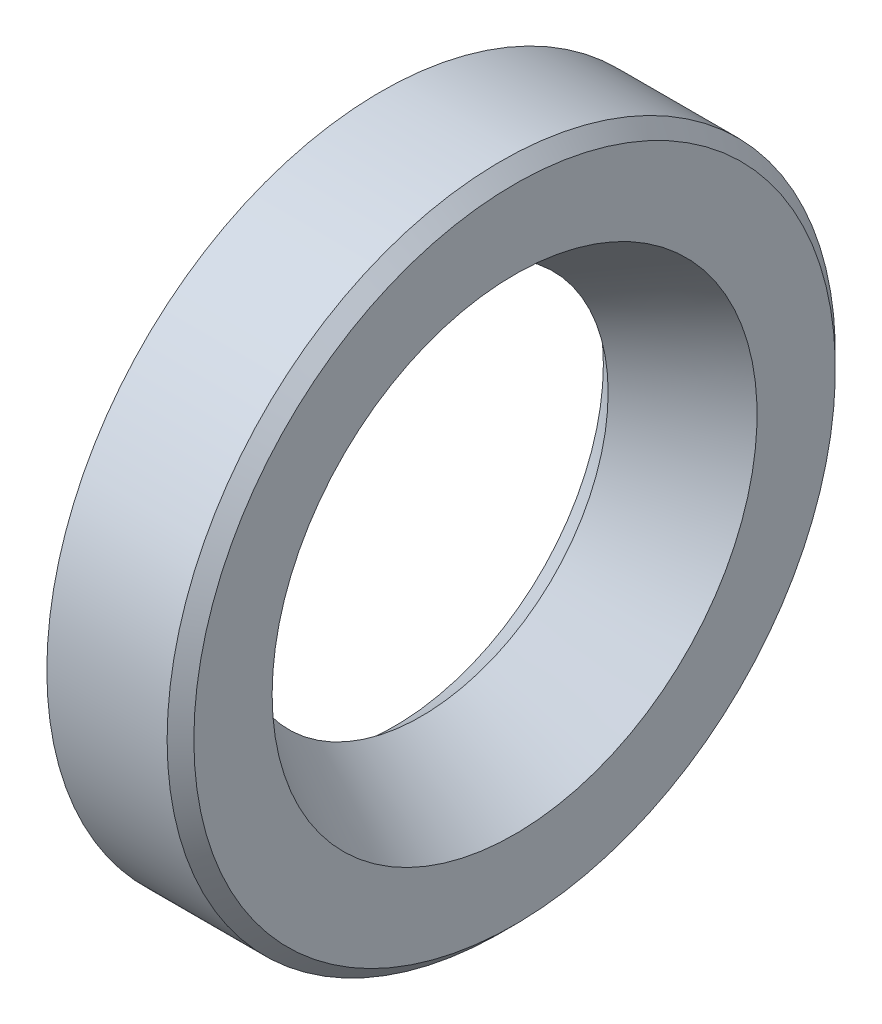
ISO-10303-21;
HEADER;
FILE_DESCRIPTION(('STEP AP214'),'2;1');
FILE_NAME('part.step','',(''),(''),'','','');
FILE_SCHEMA(('AUTOMOTIVE_DESIGN { 1 0 10303 214 1 1 1 1 }'));
ENDSEC;
DATA;
#1=APPLICATION_CONTEXT('core data for automotive mechanical design processes');
#2=APPLICATION_PROTOCOL_DEFINITION('international standard','automotive_design',2000,#1);
#3=PRODUCT_CONTEXT('',#1,'mechanical');
#4=PRODUCT('Part','Part','',(#3));
#5=PRODUCT_RELATED_PRODUCT_CATEGORY('part','',(#4));
#6=PRODUCT_DEFINITION_FORMATION('','',#4);
#7=PRODUCT_DEFINITION_CONTEXT('part definition',#1,'design');
#8=PRODUCT_DEFINITION('design','',#6,#7);
#9=PRODUCT_DEFINITION_SHAPE('','',#8);
#10=(LENGTH_UNIT() NAMED_UNIT(*) SI_UNIT(.MILLI.,.METRE.));
#11=(NAMED_UNIT(*) PLANE_ANGLE_UNIT() SI_UNIT($,.RADIAN.));
#12=(NAMED_UNIT(*) SI_UNIT($,.STERADIAN.) SOLID_ANGLE_UNIT());
#13=UNCERTAINTY_MEASURE_WITH_UNIT(LENGTH_MEASURE(1.E-05),#10,'distance_accuracy_value','');
#14=(GEOMETRIC_REPRESENTATION_CONTEXT(3) GLOBAL_UNCERTAINTY_ASSIGNED_CONTEXT((#13)) GLOBAL_UNIT_ASSIGNED_CONTEXT((#10,
#11,#12)) REPRESENTATION_CONTEXT('',''));
#15=CARTESIAN_POINT('',(0.,0.,0.));
#16=DIRECTION('',(0.,0.,1.));
#17=DIRECTION('',(1.,0.,0.));
#18=AXIS2_PLACEMENT_3D('',#15,#16,#17);
#19=CARTESIAN_POINT('',(5.66666666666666,0.,0.));
#20=DIRECTION('',(-1.,0.,0.));
#21=DIRECTION('',(0.,0.,1.));
#22=AXIS2_PLACEMENT_3D('',#19,#20,#21);
#23=TOROIDAL_SURFACE('',#22,22.2222222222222,0.999999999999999);
#24=CARTESIAN_POINT('',(6.66666666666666,0.,0.));
#25=DIRECTION('',(-1.,0.,0.));
#26=DIRECTION('',(0.,0.,1.));
#27=AXIS2_PLACEMENT_3D('',#24,#25,#26);
#28=CIRCLE('',#27,22.2222222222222);
#29=CARTESIAN_POINT('',(6.66666666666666,0.,22.2222222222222));
#30=VERTEX_POINT('',#29);
#31=EDGE_CURVE('E10',#30,#30,#28,.T.);
#32=ORIENTED_EDGE('',*,*,#31,.F.);
#33=EDGE_LOOP('',(#32));
#34=FACE_BOUND('',#33,.T.);
#35=CARTESIAN_POINT('',(5.66666666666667,0.,0.));
#36=DIRECTION('',(-1.,0.,0.));
#37=DIRECTION('',(0.,0.,1.));
#38=AXIS2_PLACEMENT_3D('',#35,#36,#37);
#39=CIRCLE('',#38,23.2222222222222);
#40=CARTESIAN_POINT('',(5.66666666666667,0.,23.2222222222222));
#41=VERTEX_POINT('',#40);
#42=EDGE_CURVE('E76',#41,#41,#39,.T.);
#43=ORIENTED_EDGE('',*,*,#42,.T.);
#44=EDGE_LOOP('',(#43));
#45=FACE_BOUND('',#44,.T.);
#46=ADVANCED_FACE('F30',(#34,#45),#23,.F.);
#47=CARTESIAN_POINT('',(6.66666666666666,22.2222222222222,0.));
#48=DIRECTION('',(1.,0.,0.));
#49=DIRECTION('',(0.,0.,-1.));
#50=AXIS2_PLACEMENT_3D('',#47,#48,#49);
#51=PLANE('',#50);
#52=CARTESIAN_POINT('',(6.66666666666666,0.,0.));
#53=DIRECTION('',(-1.,0.,0.));
#54=DIRECTION('',(0.,0.,1.));
#55=AXIS2_PLACEMENT_3D('',#52,#53,#54);
#56=CIRCLE('',#55,18.1428571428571);
#57=CARTESIAN_POINT('',(6.66666666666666,0.,18.1428571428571));
#58=VERTEX_POINT('',#57);
#59=EDGE_CURVE('E36',#58,#58,#56,.T.);
#60=ORIENTED_EDGE('',*,*,#59,.F.);
#61=EDGE_LOOP('',(#60));
#62=FACE_BOUND('',#61,.T.);
#63=ORIENTED_EDGE('',*,*,#31,.T.);
#64=EDGE_LOOP('',(#63));
#65=FACE_BOUND('',#64,.T.);
#66=ADVANCED_FACE('F149',(#62,#65),#51,.F.);
#67=CARTESIAN_POINT('',(5.66666666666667,0.,0.));
#68=DIRECTION('',(-1.,0.,0.));
#69=DIRECTION('',(0.,0.,1.));
#70=AXIS2_PLACEMENT_3D('',#67,#68,#69);
#71=TOROIDAL_SURFACE('',#70,18.1428571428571,0.999999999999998);
#72=CARTESIAN_POINT('',(5.66666666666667,0.,0.));
#73=DIRECTION('',(-1.,0.,0.));
#74=DIRECTION('',(0.,0.,1.));
#75=AXIS2_PLACEMENT_3D('',#72,#73,#74);
#76=CIRCLE('',#75,17.1428571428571);
#77=CARTESIAN_POINT('',(5.66666666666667,0.,17.1428571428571));
#78=VERTEX_POINT('',#77);
#79=EDGE_CURVE('E40',#78,#78,#76,.T.);
#80=ORIENTED_EDGE('',*,*,#79,.F.);
#81=EDGE_LOOP('',(#80));
#82=FACE_BOUND('',#81,.T.);
#83=ORIENTED_EDGE('',*,*,#59,.T.);
#84=EDGE_LOOP('',(#83));
#85=FACE_BOUND('',#84,.T.);
#86=ADVANCED_FACE('F144',(#82,#85),#71,.F.);
#87=CARTESIAN_POINT('',(-10.,0.,0.));
#88=DIRECTION('',(-1.,0.,0.));
#89=DIRECTION('',(0.,0.,1.));
#90=AXIS2_PLACEMENT_3D('',#87,#88,#89);
#91=CYLINDRICAL_SURFACE('',#90,17.1428571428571);
#92=CARTESIAN_POINT('',(3.,0.,0.));
#93=DIRECTION('',(-1.,0.,0.));
#94=DIRECTION('',(0.,0.,1.));
#95=AXIS2_PLACEMENT_3D('',#92,#93,#94);
#96=CIRCLE('',#95,17.1428571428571);
#97=CARTESIAN_POINT('',(3.,0.,17.1428571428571));
#98=VERTEX_POINT('',#97);
#99=EDGE_CURVE('E44',#98,#98,#96,.T.);
#100=ORIENTED_EDGE('',*,*,#99,.F.);
#101=EDGE_LOOP('',(#100));
#102=FACE_BOUND('',#101,.T.);
#103=ORIENTED_EDGE('',*,*,#79,.T.);
#104=EDGE_LOOP('',(#103));
#105=FACE_BOUND('',#104,.T.);
#106=ADVANCED_FACE('F138',(#102,#105),#91,.T.);
#107=CARTESIAN_POINT('',(3.,0.,0.));
#108=DIRECTION('',(-1.,0.,0.));
#109=DIRECTION('',(0.,0.,1.));
#110=AXIS2_PLACEMENT_3D('',#107,#108,#109);
#111=TOROIDAL_SURFACE('',#110,18.1428571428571,0.999999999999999);
#112=CARTESIAN_POINT('',(2.,0.,0.));
#113=DIRECTION('',(-1.,0.,0.));
#114=DIRECTION('',(0.,0.,1.));
#115=AXIS2_PLACEMENT_3D('',#112,#113,#114);
#116=CIRCLE('',#115,18.1428571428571);
#117=CARTESIAN_POINT('',(2.,0.,18.1428571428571));
#118=VERTEX_POINT('',#117);
#119=EDGE_CURVE('E49',#118,#118,#116,.T.);
#120=ORIENTED_EDGE('',*,*,#119,.F.);
#121=EDGE_LOOP('',(#120));
#122=FACE_BOUND('',#121,.T.);
#123=ORIENTED_EDGE('',*,*,#99,.T.);
#124=EDGE_LOOP('',(#123));
#125=FACE_BOUND('',#124,.T.);
#126=ADVANCED_FACE('F132',(#122,#125),#111,.T.);
#127=CARTESIAN_POINT('',(-10.,0.,0.));
#128=DIRECTION('',(-1.,0.,0.));
#129=DIRECTION('',(0.,0.,1.));
#130=AXIS2_PLACEMENT_3D('',#127,#128,#129);
#131=CYLINDRICAL_SURFACE('',#130,18.1428571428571);
#132=CARTESIAN_POINT('',(0.999999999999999,0.,0.));
#133=DIRECTION('',(-1.,0.,0.));
#134=DIRECTION('',(0.,0.,1.));
#135=AXIS2_PLACEMENT_3D('',#132,#133,#134);
#136=CIRCLE('',#135,18.1428571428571);
#137=CARTESIAN_POINT('',(0.999999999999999,0.,18.1428571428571));
#138=VERTEX_POINT('',#137);
#139=EDGE_CURVE('E52',#138,#138,#136,.T.);
#140=ORIENTED_EDGE('',*,*,#139,.F.);
#141=EDGE_LOOP('',(#140));
#142=FACE_BOUND('',#141,.T.);
#143=ORIENTED_EDGE('',*,*,#119,.T.);
#144=EDGE_LOOP('',(#143));
#145=FACE_BOUND('',#144,.T.);
#146=ADVANCED_FACE('F126',(#142,#145),#131,.T.);
#147=CARTESIAN_POINT('',(1.,18.1428571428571,0.));
#148=DIRECTION('',(1.,0.,0.));
#149=DIRECTION('',(0.,0.,-1.));
#150=AXIS2_PLACEMENT_3D('',#147,#148,#149);
#151=PLANE('',#150);
#152=CARTESIAN_POINT('',(0.999999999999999,0.,0.));
#153=DIRECTION('',(-1.,0.,0.));
#154=DIRECTION('',(0.,0.,1.));
#155=AXIS2_PLACEMENT_3D('',#152,#153,#154);
#156=CIRCLE('',#155,15.6417311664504);
#157=CARTESIAN_POINT('',(0.999999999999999,0.,15.6417311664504));
#158=VERTEX_POINT('',#157);
#159=EDGE_CURVE('E55',#158,#158,#156,.T.);
#160=ORIENTED_EDGE('',*,*,#159,.F.);
#161=EDGE_LOOP('',(#160));
#162=FACE_BOUND('',#161,.T.);
#163=ORIENTED_EDGE('',*,*,#139,.T.);
#164=EDGE_LOOP('',(#163));
#165=FACE_BOUND('',#164,.T.);
#166=ADVANCED_FACE('F120',(#162,#165),#151,.F.);
#167=CARTESIAN_POINT('',(0.999999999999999,0.,0.));
#168=DIRECTION('',(-1.,0.,0.));
#169=DIRECTION('',(0.,0.,1.));
#170=AXIS2_PLACEMENT_3D('',#167,#168,#169);
#171=CONICAL_SURFACE('',#170,15.6417311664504,0.687334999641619);
#172=CARTESIAN_POINT('',(3.,0.,0.));
#173=DIRECTION('',(-1.,0.,0.));
#174=DIRECTION('',(0.,0.,1.));
#175=AXIS2_PLACEMENT_3D('',#172,#173,#174);
#176=CIRCLE('',#175,14.);
#177=CARTESIAN_POINT('',(3.,0.,14.));
#178=VERTEX_POINT('',#177);
#179=EDGE_CURVE('E58',#178,#178,#176,.T.);
#180=ORIENTED_EDGE('',*,*,#179,.F.);
#181=EDGE_LOOP('',(#180));
#182=FACE_BOUND('',#181,.T.);
#183=ORIENTED_EDGE('',*,*,#159,.T.);
#184=EDGE_LOOP('',(#183));
#185=FACE_BOUND('',#184,.T.);
#186=ADVANCED_FACE('F114',(#182,#185),#171,.F.);
#187=CARTESIAN_POINT('',(3.,0.,0.));
#188=DIRECTION('',(1.,0.,0.));
#189=DIRECTION('',(0.,0.,-1.));
#190=AXIS2_PLACEMENT_3D('',#187,#188,#189);
#191=CONICAL_SURFACE('',#190,14.,0.534395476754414);
#192=CARTESIAN_POINT('',(10.,0.,0.));
#193=DIRECTION('',(-1.,0.,0.));
#194=DIRECTION('',(0.,0.,1.));
#195=AXIS2_PLACEMENT_3D('',#192,#193,#194);
#196=CIRCLE('',#195,18.1428571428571);
#197=CARTESIAN_POINT('',(10.,0.,18.1428571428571));
#198=VERTEX_POINT('',#197);
#199=EDGE_CURVE('E61',#198,#198,#196,.T.);
#200=ORIENTED_EDGE('',*,*,#199,.F.);
#201=EDGE_LOOP('',(#200));
#202=FACE_BOUND('',#201,.T.);
#203=ORIENTED_EDGE('',*,*,#179,.T.);
#204=EDGE_LOOP('',(#203));
#205=FACE_BOUND('',#204,.T.);
#206=ADVANCED_FACE('F108',(#202,#205),#191,.F.);
#207=CARTESIAN_POINT('',(10.,18.1428571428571,0.));
#208=DIRECTION('',(-1.,0.,0.));
#209=DIRECTION('',(0.,0.,1.));
#210=AXIS2_PLACEMENT_3D('',#207,#208,#209);
#211=PLANE('',#210);
#212=CARTESIAN_POINT('',(10.,0.,0.));
#213=DIRECTION('',(-1.,0.,0.));
#214=DIRECTION('',(0.,0.,1.));
#215=AXIS2_PLACEMENT_3D('',#212,#213,#214);
#216=CIRCLE('',#215,24.);
#217=CARTESIAN_POINT('',(10.,0.,24.));
#218=VERTEX_POINT('',#217);
#219=EDGE_CURVE('E64',#218,#218,#216,.T.);
#220=ORIENTED_EDGE('',*,*,#219,.F.);
#221=EDGE_LOOP('',(#220));
#222=FACE_BOUND('',#221,.T.);
#223=ORIENTED_EDGE('',*,*,#199,.T.);
#224=EDGE_LOOP('',(#223));
#225=FACE_BOUND('',#224,.T.);
#226=ADVANCED_FACE('F102',(#222,#225),#211,.F.);
#227=CARTESIAN_POINT('',(10.,0.,0.));
#228=DIRECTION('',(-1.,0.,0.));
#229=DIRECTION('',(0.,0.,1.));
#230=AXIS2_PLACEMENT_3D('',#227,#228,#229);
#231=CONICAL_SURFACE('',#230,24.,0.785398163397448);
#232=CARTESIAN_POINT('',(9.,0.,0.));
#233=DIRECTION('',(-1.,0.,0.));
#234=DIRECTION('',(0.,0.,1.));
#235=AXIS2_PLACEMENT_3D('',#232,#233,#234);
#236=CIRCLE('',#235,25.);
#237=CARTESIAN_POINT('',(9.,0.,25.));
#238=VERTEX_POINT('',#237);
#239=EDGE_CURVE('E67',#238,#238,#236,.T.);
#240=ORIENTED_EDGE('',*,*,#239,.F.);
#241=EDGE_LOOP('',(#240));
#242=FACE_BOUND('',#241,.T.);
#243=ORIENTED_EDGE('',*,*,#219,.T.);
#244=EDGE_LOOP('',(#243));
#245=FACE_BOUND('',#244,.T.);
#246=ADVANCED_FACE('F96',(#242,#245),#231,.T.);
#247=CARTESIAN_POINT('',(-10.,0.,0.));
#248=DIRECTION('',(-1.,0.,0.));
#249=DIRECTION('',(0.,0.,1.));
#250=AXIS2_PLACEMENT_3D('',#247,#248,#249);
#251=CYLINDRICAL_SURFACE('',#250,25.);
#252=CARTESIAN_POINT('',(0.,0.,0.));
#253=DIRECTION('',(-1.,0.,0.));
#254=DIRECTION('',(0.,0.,1.));
#255=AXIS2_PLACEMENT_3D('',#252,#253,#254);
#256=CIRCLE('',#255,25.);
#257=CARTESIAN_POINT('',(0.,0.,25.));
#258=VERTEX_POINT('',#257);
#259=EDGE_CURVE('E70',#258,#258,#256,.T.);
#260=ORIENTED_EDGE('',*,*,#259,.F.);
#261=EDGE_LOOP('',(#260));
#262=FACE_BOUND('',#261,.T.);
#263=ORIENTED_EDGE('',*,*,#239,.T.);
#264=EDGE_LOOP('',(#263));
#265=FACE_BOUND('',#264,.T.);
#266=ADVANCED_FACE('F90',(#262,#265),#251,.T.);
#267=CARTESIAN_POINT('',(0.,23.2222222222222,0.));
#268=DIRECTION('',(1.,0.,0.));
#269=DIRECTION('',(0.,0.,-1.));
#270=AXIS2_PLACEMENT_3D('',#267,#268,#269);
#271=PLANE('',#270);
#272=CARTESIAN_POINT('',(0.,0.,0.));
#273=DIRECTION('',(-1.,0.,0.));
#274=DIRECTION('',(0.,0.,1.));
#275=AXIS2_PLACEMENT_3D('',#272,#273,#274);
#276=CIRCLE('',#275,23.2222222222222);
#277=CARTESIAN_POINT('',(0.,0.,23.2222222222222));
#278=VERTEX_POINT('',#277);
#279=EDGE_CURVE('E73',#278,#278,#276,.T.);
#280=ORIENTED_EDGE('',*,*,#279,.F.);
#281=EDGE_LOOP('',(#280));
#282=FACE_BOUND('',#281,.T.);
#283=ORIENTED_EDGE('',*,*,#259,.T.);
#284=EDGE_LOOP('',(#283));
#285=FACE_BOUND('',#284,.T.);
#286=ADVANCED_FACE('F84',(#282,#285),#271,.F.);
#287=CARTESIAN_POINT('',(-10.,0.,0.));
#288=DIRECTION('',(-1.,0.,0.));
#289=DIRECTION('',(0.,0.,1.));
#290=AXIS2_PLACEMENT_3D('',#287,#288,#289);
#291=CYLINDRICAL_SURFACE('',#290,23.2222222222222);
#292=ORIENTED_EDGE('',*,*,#42,.F.);
#293=EDGE_LOOP('',(#292));
#294=FACE_BOUND('',#293,.T.);
#295=ORIENTED_EDGE('',*,*,#279,.T.);
#296=EDGE_LOOP('',(#295));
#297=FACE_BOUND('',#296,.T.);
#298=ADVANCED_FACE('F81',(#294,#297),#291,.F.);
#299=CLOSED_SHELL('',(#46,#66,#86,#106,#126,#146,#166,#186,#206,#226,#246,#266,#286,#298));
#300=MANIFOLD_SOLID_BREP('B2',#299);
#301=ADVANCED_BREP_SHAPE_REPRESENTATION('',(#18,#300),#14);
#302=SHAPE_DEFINITION_REPRESENTATION(#9,#301);
ENDSEC;
END-ISO-10303-21;
